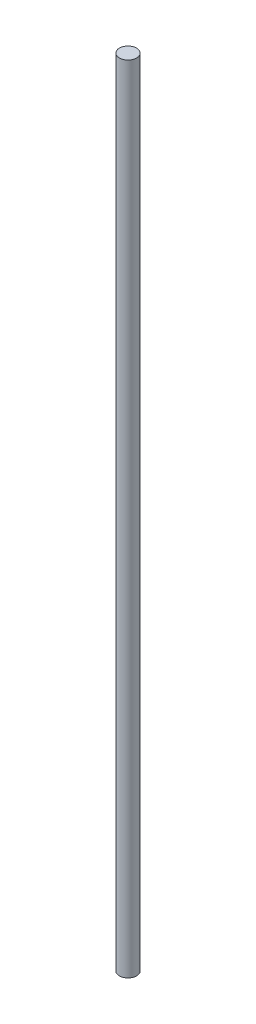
from build123d import *

# Parameters (mm, degrees)
SCHIZZO1_R                   = 2
ESTRUSIONE_ESTRUSIONE1_DEPTH = 185


with BuildPart() as part:
    # Schizzo1 → Estrusione-Estrusione1 (new body)
    with BuildSketch(Plane(origin=(0, 0, 0), x_dir=(1, 0, 0), z_dir=(0, 1, 0))):
        with Locations(Location((0, 0, 0), (0, 0, 270))):
            Circle(SCHIZZO1_R)
    extrude(amount=ESTRUSIONE_ESTRUSIONE1_DEPTH)


solid = part.part
